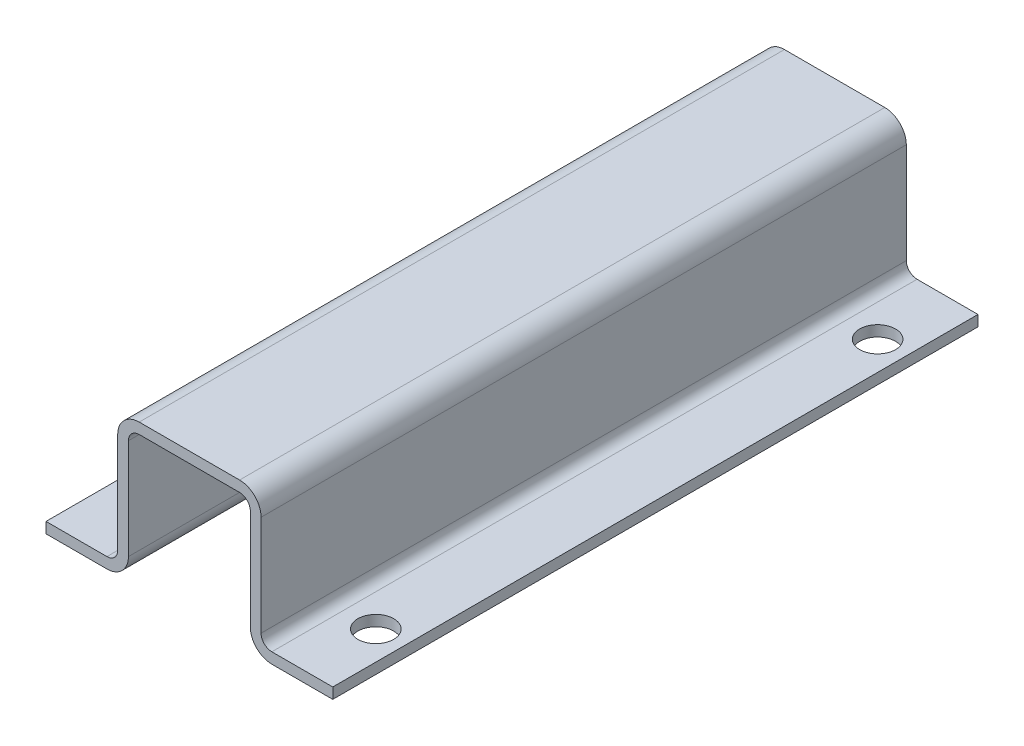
from build123d import *

# Parameters (mm, degrees)
EXTRU_MINCE1_DEPTH      = 45
ESQUISSE2_R             = 2.5
ENL_V_MAT_EXTRU_1_DEPTH = 90


with BuildPart() as part:
    # Esquisse1 → Extru.-Mince1 (new, symmetric)
    with BuildSketch(Plane.XY):
        with BuildLine():
            Line((-20, 0), (-11.5, 0))
            ThreePointArc((-11.5, 0), (-10.439339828, 0.439339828), (-10, 1.5))
            Line((-10, 1.5), (-10, 15.5))
            ThreePointArc((-10, 15.5), (-9.121320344, 17.621320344), (-7, 18.5))
            Line((-7, 18.5), (7, 18.5))
            ThreePointArc((7, 18.5), (9.121320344, 17.621320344), (10, 15.5))
            Line((10, 15.5), (10, 1.5))
            ThreePointArc((10, 1.5), (10.439339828, 0.439339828), (11.5, 0))
            Line((11.5, 0), (20, 0))
            Line((20, 0), (20, -1.5))
            Line((20, -1.5), (11.5, -1.5))
            ThreePointArc((11.5, -1.5), (9.378679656, -0.621320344), (8.5, 1.5))
            Line((8.5, 1.5), (8.5, 15.5))
            ThreePointArc((8.5, 15.5), (8.060660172, 16.560660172), (7, 17))
            Line((7, 17), (-7, 17))
            ThreePointArc((-7, 17), (-8.060660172, 16.560660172), (-8.5, 15.5))
            Line((-8.5, 15.5), (-8.5, 1.5))
            ThreePointArc((-8.5, 1.5), (-9.378679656, -0.621320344), (-11.5, -1.5))
            Line((-11.5, -1.5), (-20, -1.5))
            Line((-20, -1.5), (-20, 0))
        make_face()
    extrude(amount=EXTRU_MINCE1_DEPTH, both=True)

    # Esquisse2 → Enl_v. mat.-Extru.1 (cut)
    with BuildSketch(Plane(origin=(0, 0, 0), x_dir=(-1, 0, 0), z_dir=(0, 1, 0))):
        with Locations((-16, 35)):
            Circle(ESQUISSE2_R)
        with Locations((16, 35)):
            Circle(ESQUISSE2_R)
        with Locations((16, -35)):
            Circle(ESQUISSE2_R)
        with Locations((-16, -35)):
            Circle(ESQUISSE2_R)
    extrude(amount=-ENL_V_MAT_EXTRU_1_DEPTH, mode=Mode.SUBTRACT)


solid = part.part
